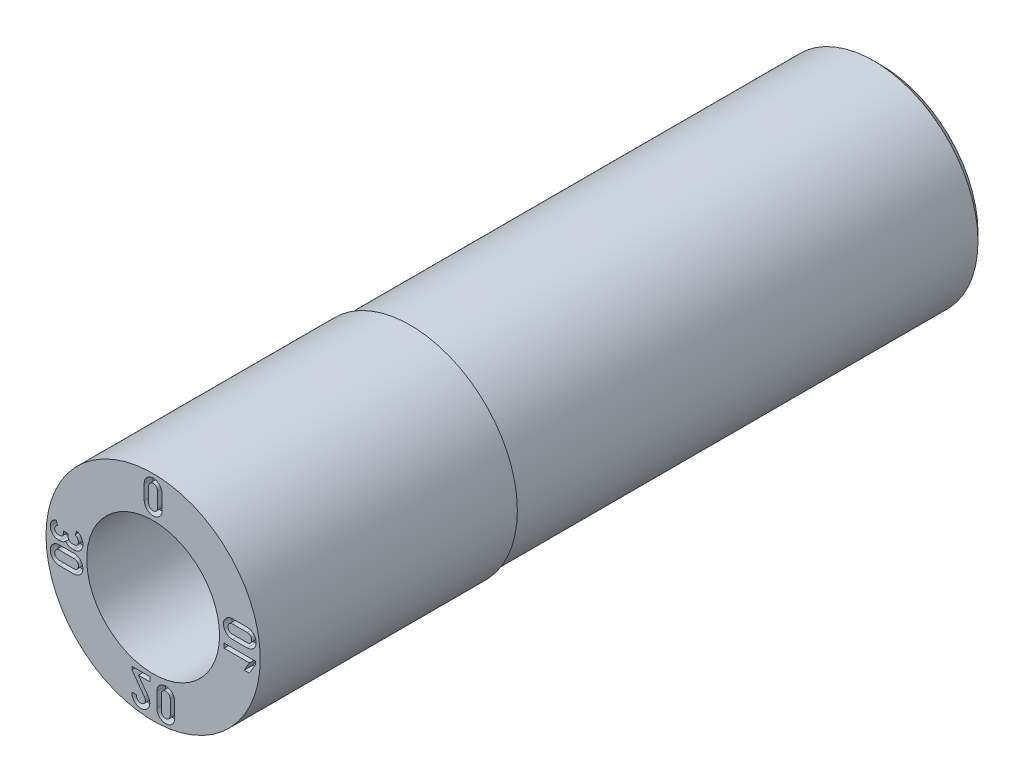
from build123d import *

# Parameters (mm, degrees)
SKETCH4_W          = 11
SKETCH4_H          = 1
CUT_EXTRUDE1_DEPTH = 0.2
CUT_EXTRUDE2_DEPTH = 1.4


with BuildPart() as part:
    # Sketch1 → Revolve1 (revolve)
    with BuildSketch(Plane(origin=(0, 0, 0), x_dir=(0, 0, -1), z_dir=(1, 0, 0)), mode=Mode.PRIVATE) as revolve1_sk:
        Polygon((0, 2.5), (0, 1.55), (2.8, 1.55), (2.8, 0.8), (14, 0.8), (14, 1.5), (17, 1.5), (17, 2.25), (16.75, 2.5), align=None)
    revolve(revolve1_sk.sketch.rotate(Axis((0, 0, 3.797909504), (0, 0, -1)), 90), axis=Axis((0, 0, 3.797909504), (0, 0, -1)))

    # Sketch4 → Cut-Revolve1 (revolve, cut)
    with BuildSketch(Plane(origin=(0, 0, 0), x_dir=(0, 0, -1), z_dir=(1, 0, 0)), mode=Mode.PRIVATE) as cut_revolve1_sk:
        with Locations((11.5, 2.935)):
            Rectangle(SKETCH4_W, SKETCH4_H)
    revolve(cut_revolve1_sk.sketch.rotate(Axis((0, 0, 0), (0, 0, -1)), 90), axis=Axis((0, 0, 0), (0, 0, -1)), mode=Mode.SUBTRACT)

    # Sketch2 → Cut-Extrude1 (cut)
    # profile 1 of 7: a face of its own
    with BuildSketch(Plane.XY):
        with BuildLine():
            Line((-2.19211994, -0.037044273), (-1.847452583, -0.03707375))
            ThreePointArc((-1.847452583, -0.03707375), (-1.638543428, -0.24601018), (-1.847479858, -0.454919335))
            Line((-1.847479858, -0.454919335), (-2.192155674, -0.454889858))
            ThreePointArc((-2.192155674, -0.454889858), (-2.401060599, -0.245949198), (-2.19211994, -0.037044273))
        make_face()
        with BuildLine():
            Line((-1.847466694, -0.350487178), (-2.192146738, -0.350399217))
            ThreePointArc((-2.192146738, -0.350399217), (-2.296569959, -0.245958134), (-2.192128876, -0.141534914))
            Line((-2.192128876, -0.141534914), (-1.847445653, -0.141505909))
            ThreePointArc((-1.847445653, -0.141505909), (-1.742975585, -0.246007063), (-1.847466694, -0.350487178))
        make_face(mode=Mode.SUBTRACT)
    # profile 2 of 7: a face of its own
    with BuildSketch(Plane.XY):
        with BuildLine():
            Line((-0.208031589, 2.196780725), (-0.208002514, 1.852113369))
            ThreePointArc((-0.208002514, 1.852113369), (0.000933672, 1.643192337), (0.20984307, 1.852140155))
            Line((0.20984307, 1.852140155), (0.209872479, 2.196815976))
            ThreePointArc((0.209872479, 2.196815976), (0.00090282, 2.405750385), (-0.208031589, 2.196780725))
        make_face()
        with BuildLine():
            Line((0.105381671, 1.852131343), (0.105352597, 2.19680716))
            ThreePointArc((0.105352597, 2.19680716), (0.000911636, 2.301230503), (-0.103511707, 2.196789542))
            Line((-0.103511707, 2.196789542), (-0.103541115, 1.852106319))
            ThreePointArc((-0.103541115, 1.852106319), (0.000932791, 1.747653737), (0.105381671, 1.852131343))
        make_face(mode=Mode.SUBTRACT)
    # profile 3 of 7: a face of its own
    with BuildSketch(Plane.XY):
        with BuildLine():
            Line((-0.077941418, -1.74715536), (-0.07795023, -1.64269252))
            Line((-0.07795023, -1.64269252), (-0.495737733, -1.642727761))
            Line((-0.495737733, -1.642727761), (-0.495731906, -1.711803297))
            Line((-0.495731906, -1.711803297), (-0.201994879, -2.119534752))
            ThreePointArc((-0.201994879, -2.119534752), (-0.262244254, -2.282157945), (-0.390053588, -2.16493566))
            Line((-0.390053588, -2.16493566), (-0.495108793, -2.164946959))
            ThreePointArc((-0.495108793, -2.164946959), (-0.230006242, -2.381626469), (-0.117111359, -2.058386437))
            Line((-0.117111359, -2.058386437), (-0.344300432, -1.747177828))
            Line((-0.344300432, -1.747177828), (-0.077941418, -1.74715536))
        make_face()
    # profile 4 of 7: a face of its own
    with BuildSketch(Plane.XY):
        Polygon((2.388019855, -0.098360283), (2.388025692, -0.167114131), (2.247409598, -0.411697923), (2.126951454, -0.41170815), (2.247011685, -0.202804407), (1.656915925, -0.202854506), (1.656907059, -0.098422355), align=None)
    # profile 5 of 7: a face of its own
    with BuildSketch(Plane.XY):
        with BuildLine():
            Line((2.195487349, 0.49061455), (1.850819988, 0.49064377))
            ThreePointArc((1.850819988, 0.49064377), (1.641899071, 0.281707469), (1.850847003, 0.072798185))
            Line((1.850847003, 0.072798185), (2.195522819, 0.072827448))
            ThreePointArc((2.195522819, 0.072827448), (2.404398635, 0.281738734), (2.195487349, 0.49061455))
        make_face()
        with BuildLine():
            Line((1.850838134, 0.177259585), (2.19551395, 0.177288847))
            ThreePointArc((2.19551395, 0.177288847), (2.299937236, 0.281729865), (2.195496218, 0.386153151))
            Line((2.195496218, 0.386153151), (1.850812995, 0.38618237))
            ThreePointArc((1.850812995, 0.38618237), (1.746360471, 0.281708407), (1.850838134, 0.177259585))
        make_face(mode=Mode.SUBTRACT)
    # profile 6 of 7: a face of its own
    with BuildSketch(Plane.XY):
        with BuildLine():
            Line((-1.847199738, 0.137142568), (-1.883756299, 0.137145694))
            ThreePointArc((-1.883756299, 0.137145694), (-1.957589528, 0.167735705), (-1.988167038, 0.241574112))
            Line((-1.988167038, 0.241574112), (-1.988162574, 0.293788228))
            Line((-1.988162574, 0.293788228), (-2.092623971, 0.293797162))
            Line((-2.092623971, 0.293797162), (-2.092628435, 0.241595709))
            ThreePointArc((-2.092628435, 0.241595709), (-2.117105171, 0.182517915), (-2.176187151, 0.158051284))
            Line((-2.176187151, 0.158051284), (-2.212738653, 0.158054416))
            ThreePointArc((-2.212738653, 0.158054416), (-2.271795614, 0.182551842), (-2.296287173, 0.241611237))
            ThreePointArc((-2.296287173, 0.241611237), (-2.278678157, 0.296428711), (-2.232379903, 0.330655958))
            Line((-2.232379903, 0.330655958), (-2.265798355, 0.429623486))
            ThreePointArc((-2.265798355, 0.429623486), (-2.363493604, 0.357326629), (-2.40073618, 0.241636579))
            ThreePointArc((-2.40073618, 0.241636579), (-2.345692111, 0.108668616), (-2.212737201, 0.053593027))
            Line((-2.212737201, 0.053593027), (-2.176196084, 0.053589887))
            ThreePointArc((-2.176196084, 0.053589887), (-2.104836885, 0.067658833), (-2.044164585, 0.10777046))
            ThreePointArc((-2.044164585, 0.10777046), (-1.972318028, 0.052378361), (-1.883760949, 0.032684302))
            Line((-1.883760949, 0.032684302), (-1.847191, 0.032681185))
            ThreePointArc((-1.847191, 0.032681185), (-1.69949045, 0.093852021), (-1.638314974, 0.24155065))
            ThreePointArc((-1.638314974, 0.24155065), (-1.677220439, 0.367887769), (-1.780448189, 0.450463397))
            Line((-1.780448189, 0.450463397), (-1.81877902, 0.353334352))
            ThreePointArc((-1.81877902, 0.353334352), (-1.763554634, 0.309163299), (-1.742747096, 0.241577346))
            ThreePointArc((-1.742747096, 0.241577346), (-1.773344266, 0.167727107), (-1.847199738, 0.137142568))
        make_face()
    # profile 7 of 7: a face of its own
    with BuildSketch(Plane.XY):
        with BuildLine():
            Line((0.504290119, -2.200354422), (0.504319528, -1.855674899))
            ThreePointArc((0.504319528, -1.855674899), (0.295383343, -1.64676973), (0.086473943, -1.855701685))
            Line((0.086473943, -1.855701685), (0.086503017, -2.200377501))
            ThreePointArc((0.086503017, -2.200377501), (0.295408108, -2.409265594), (0.504290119, -2.200354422))
        make_face()
        with BuildLine():
            Line((0.190935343, -1.855705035), (0.190964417, -2.200380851))
            ThreePointArc((0.190964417, -2.200380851), (0.295405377, -2.304804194), (0.39982872, -2.200363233))
            Line((0.39982872, -2.200363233), (0.399858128, -1.85568001))
            ThreePointArc((0.399858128, -1.85568001), (0.295384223, -1.75123113), (0.190935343, -1.855705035))
        make_face(mode=Mode.SUBTRACT)
    extrude(amount=-CUT_EXTRUDE1_DEPTH, mode=Mode.SUBTRACT)

    # Sketch3 → Cut-Extrude2 (cut)
    with BuildSketch(Plane.XY.offset(-2.8)):
        Polygon((0.461880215, 0.8), (-0.461880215, 0.8), (-0.923760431, 0), (-0.461880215, -0.8), (0.461880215, -0.8), (0.923760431, 0), align=None)
    extrude(amount=-CUT_EXTRUDE2_DEPTH, mode=Mode.SUBTRACT)


solid = part.part
